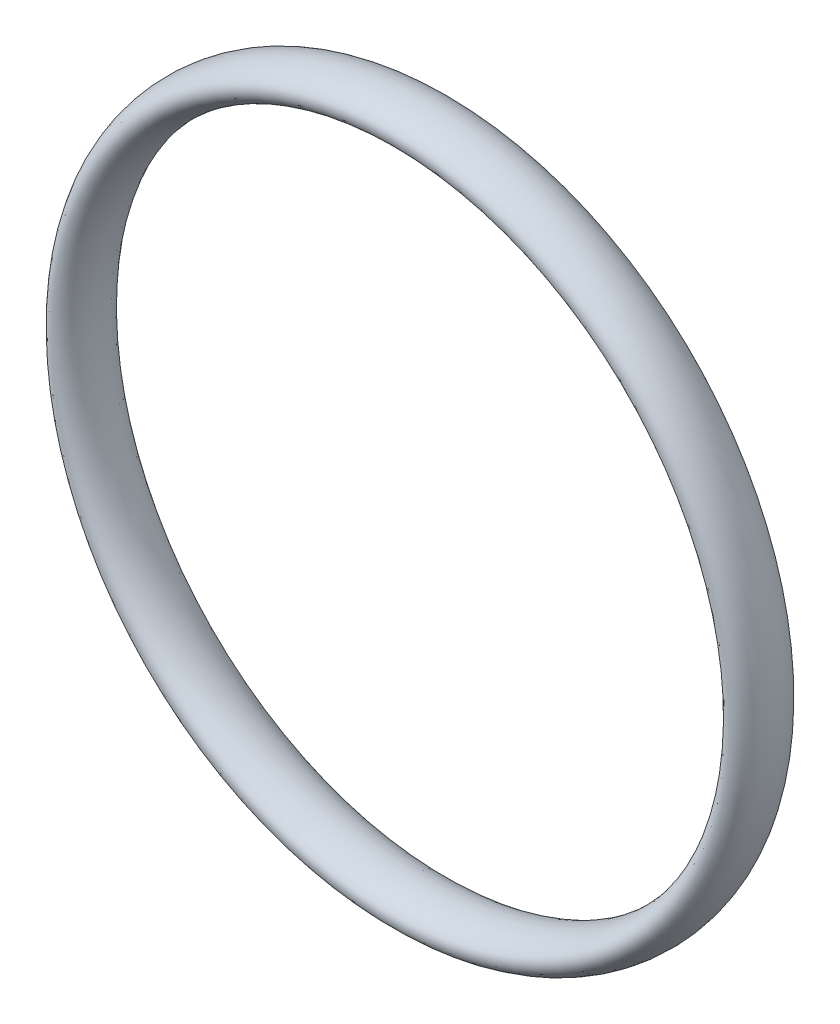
ISO-10303-21;
HEADER;
FILE_DESCRIPTION(('STEP AP214'),'2;1');
FILE_NAME('part.step','',(''),(''),'','','');
FILE_SCHEMA(('AUTOMOTIVE_DESIGN { 1 0 10303 214 1 1 1 1 }'));
ENDSEC;
DATA;
#1=APPLICATION_CONTEXT('core data for automotive mechanical design processes');
#2=APPLICATION_PROTOCOL_DEFINITION('international standard','automotive_design',2000,#1);
#3=PRODUCT_CONTEXT('',#1,'mechanical');
#4=PRODUCT('Part','Part','',(#3));
#5=PRODUCT_RELATED_PRODUCT_CATEGORY('part','',(#4));
#6=PRODUCT_DEFINITION_FORMATION('','',#4);
#7=PRODUCT_DEFINITION_CONTEXT('part definition',#1,'design');
#8=PRODUCT_DEFINITION('design','',#6,#7);
#9=PRODUCT_DEFINITION_SHAPE('','',#8);
#10=(LENGTH_UNIT() NAMED_UNIT(*) SI_UNIT(.MILLI.,.METRE.));
#11=(NAMED_UNIT(*) PLANE_ANGLE_UNIT() SI_UNIT($,.RADIAN.));
#12=(NAMED_UNIT(*) SI_UNIT($,.STERADIAN.) SOLID_ANGLE_UNIT());
#13=UNCERTAINTY_MEASURE_WITH_UNIT(LENGTH_MEASURE(1.E-05),#10,'distance_accuracy_value','');
#14=(GEOMETRIC_REPRESENTATION_CONTEXT(3) GLOBAL_UNCERTAINTY_ASSIGNED_CONTEXT((#13)) GLOBAL_UNIT_ASSIGNED_CONTEXT((#10,
#11,#12)) REPRESENTATION_CONTEXT('',''));
#15=CARTESIAN_POINT('',(0.,0.,0.));
#16=DIRECTION('',(0.,0.,1.));
#17=DIRECTION('',(1.,0.,0.));
#18=AXIS2_PLACEMENT_3D('',#15,#16,#17);
#19=CARTESIAN_POINT('',(0.,20.05,-1.8));
#20=DIRECTION('',(1.,0.,0.));
#21=DIRECTION('',(0.,0.,-1.));
#22=AXIS2_PLACEMENT_3D('',#19,#20,#21);
#23=ELLIPSE('',#22,1.8,1.05);
#24=CARTESIAN_POINT('',(0.,0.,0.));
#25=DIRECTION('',(0.,0.,1.));
#26=AXIS1_PLACEMENT('',#24,#25);
#27=SURFACE_OF_REVOLUTION('',#23,#26);
#28=ADVANCED_FACE('F28',(),#27,.T.);
#29=CLOSED_SHELL('',(#28));
#30=MANIFOLD_SOLID_BREP('B2',#29);
#31=ADVANCED_BREP_SHAPE_REPRESENTATION('',(#18,#30),#14);
#32=SHAPE_DEFINITION_REPRESENTATION(#9,#31);
ENDSEC;
END-ISO-10303-21;
